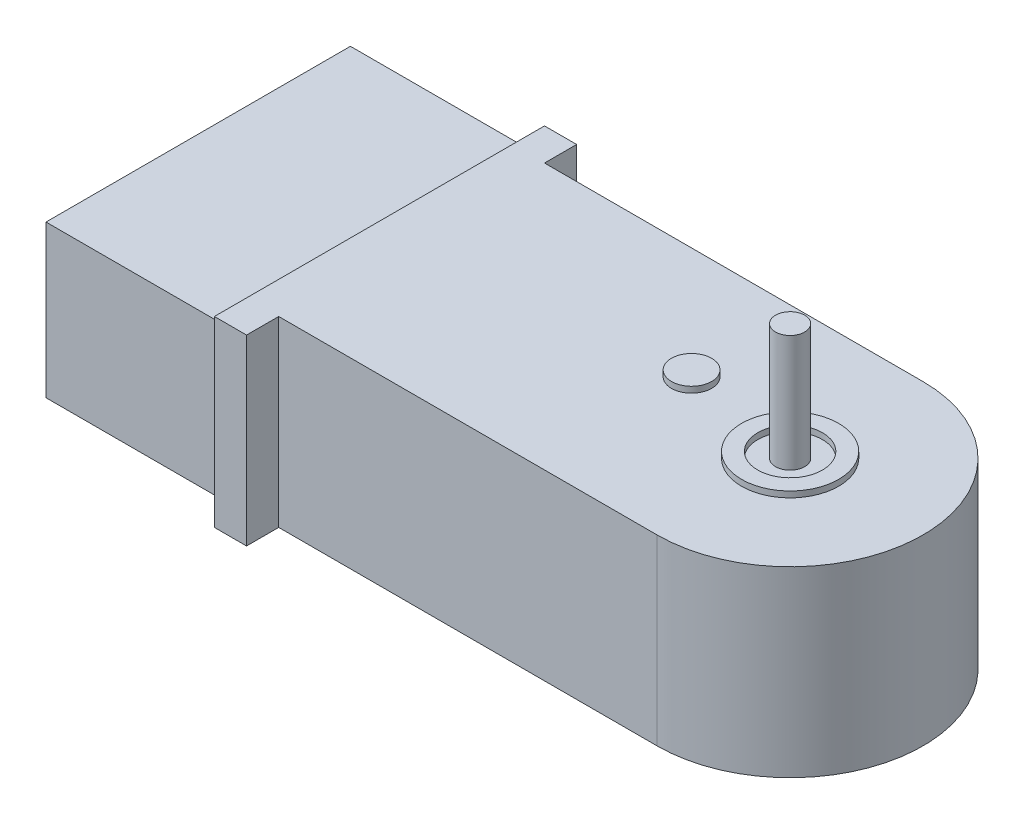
ISO-10303-21;
HEADER;
FILE_DESCRIPTION(('STEP AP214'),'2;1');
FILE_NAME('part.step','',(''),(''),'','','');
FILE_SCHEMA(('AUTOMOTIVE_DESIGN { 1 0 10303 214 1 1 1 1 }'));
ENDSEC;
DATA;
#1=APPLICATION_CONTEXT('core data for automotive mechanical design processes');
#2=APPLICATION_PROTOCOL_DEFINITION('international standard','automotive_design',2000,#1);
#3=PRODUCT_CONTEXT('',#1,'mechanical');
#4=PRODUCT('Part','Part','',(#3));
#5=PRODUCT_RELATED_PRODUCT_CATEGORY('part','',(#4));
#6=PRODUCT_DEFINITION_FORMATION('','',#4);
#7=PRODUCT_DEFINITION_CONTEXT('part definition',#1,'design');
#8=PRODUCT_DEFINITION('design','',#6,#7);
#9=PRODUCT_DEFINITION_SHAPE('','',#8);
#10=(LENGTH_UNIT() NAMED_UNIT(*) SI_UNIT(.MILLI.,.METRE.));
#11=(NAMED_UNIT(*) PLANE_ANGLE_UNIT() SI_UNIT($,.RADIAN.));
#12=(NAMED_UNIT(*) SI_UNIT($,.STERADIAN.) SOLID_ANGLE_UNIT());
#13=UNCERTAINTY_MEASURE_WITH_UNIT(LENGTH_MEASURE(1.E-05),#10,'distance_accuracy_value','');
#14=(GEOMETRIC_REPRESENTATION_CONTEXT(3) GLOBAL_UNCERTAINTY_ASSIGNED_CONTEXT((#13)) GLOBAL_UNIT_ASSIGNED_CONTEXT((#10,
#11,#12)) REPRESENTATION_CONTEXT('',''));
#15=CARTESIAN_POINT('',(0.,0.,0.));
#16=DIRECTION('',(0.,0.,1.));
#17=DIRECTION('',(1.,0.,0.));
#18=AXIS2_PLACEMENT_3D('',#15,#16,#17);
#19=CARTESIAN_POINT('',(0.,6.86,0.));
#20=DIRECTION('',(0.,1.,0.));
#21=DIRECTION('',(0.,0.,1.));
#22=AXIS2_PLACEMENT_3D('',#19,#20,#21);
#23=PLANE('',#22);
#24=CARTESIAN_POINT('',(0.,6.86,0.));
#25=DIRECTION('',(0.,1.,0.));
#26=DIRECTION('',(0.,0.,1.));
#27=AXIS2_PLACEMENT_3D('',#24,#25,#26);
#28=CIRCLE('',#27,2.43);
#29=CARTESIAN_POINT('',(0.,6.86,2.43));
#30=VERTEX_POINT('',#29);
#31=EDGE_CURVE('E40',#30,#30,#28,.F.);
#32=ORIENTED_EDGE('',*,*,#31,.F.);
#33=EDGE_LOOP('',(#32));
#34=FACE_BOUND('',#33,.T.);
#35=CARTESIAN_POINT('',(0.,6.86,0.));
#36=DIRECTION('',(0.,1.,0.));
#37=DIRECTION('',(0.,0.,1.));
#38=AXIS2_PLACEMENT_3D('',#35,#36,#37);
#39=CIRCLE('',#38,1.095);
#40=CARTESIAN_POINT('',(0.,6.86,1.095));
#41=VERTEX_POINT('',#40);
#42=EDGE_CURVE('E227',#41,#41,#39,.T.);
#43=ORIENTED_EDGE('',*,*,#42,.F.);
#44=EDGE_LOOP('',(#43));
#45=FACE_BOUND('',#44,.T.);
#46=ADVANCED_FACE('F32',(#34,#45),#23,.T.);
#47=CARTESIAN_POINT('',(0.,-6.86,0.));
#48=DIRECTION('',(0.,1.,0.));
#49=DIRECTION('',(0.,0.,1.));
#50=AXIS2_PLACEMENT_3D('',#47,#48,#49);
#51=PLANE('',#50);
#52=CARTESIAN_POINT('',(0.,-6.86,0.));
#53=DIRECTION('',(0.,1.,0.));
#54=DIRECTION('',(0.,0.,1.));
#55=AXIS2_PLACEMENT_3D('',#52,#53,#54);
#56=CIRCLE('',#55,9.98);
#57=CARTESIAN_POINT('',(0.,-6.86,9.98));
#58=VERTEX_POINT('',#57);
#59=CARTESIAN_POINT('',(0.,-6.86,-9.98));
#60=VERTEX_POINT('',#59);
#61=EDGE_CURVE('E178',#58,#60,#56,.T.);
#62=ORIENTED_EDGE('',*,*,#61,.F.);
#63=DIRECTION('',(1.,0.,0.));
#64=VECTOR('',#63,1.);
#65=CARTESIAN_POINT('',(-28.425,-6.86,9.98));
#66=LINE('',#65,#64);
#67=CARTESIAN_POINT('',(-28.425,-6.86,9.98));
#68=VERTEX_POINT('',#67);
#69=EDGE_CURVE('E198',#68,#58,#66,.T.);
#70=ORIENTED_EDGE('',*,*,#69,.F.);
#71=DIRECTION('',(0.,0.,-1.));
#72=VECTOR('',#71,1.);
#73=CARTESIAN_POINT('',(-28.425,-6.86,12.395));
#74=LINE('',#73,#72);
#75=CARTESIAN_POINT('',(-28.425,-6.86,12.395));
#76=VERTEX_POINT('',#75);
#77=EDGE_CURVE('E195',#76,#68,#74,.T.);
#78=ORIENTED_EDGE('',*,*,#77,.F.);
#79=DIRECTION('',(1.,0.,0.));
#80=VECTOR('',#79,1.);
#81=CARTESIAN_POINT('',(-30.84,-6.86,12.395));
#82=LINE('',#81,#80);
#83=CARTESIAN_POINT('',(-30.84,-6.86,12.395));
#84=VERTEX_POINT('',#83);
#85=EDGE_CURVE('E192',#84,#76,#82,.T.);
#86=ORIENTED_EDGE('',*,*,#85,.F.);
#87=DIRECTION('',(0.,0.,1.));
#88=VECTOR('',#87,1.);
#89=CARTESIAN_POINT('',(-30.84,-6.86,-12.395));
#90=LINE('',#89,#88);
#91=CARTESIAN_POINT('',(-30.84,-6.86,-12.395));
#92=VERTEX_POINT('',#91);
#93=EDGE_CURVE('E189',#92,#84,#90,.T.);
#94=ORIENTED_EDGE('',*,*,#93,.F.);
#95=DIRECTION('',(-1.,0.,0.));
#96=VECTOR('',#95,1.);
#97=CARTESIAN_POINT('',(-28.425,-6.86,-12.395));
#98=LINE('',#97,#96);
#99=CARTESIAN_POINT('',(-28.425,-6.86,-12.395));
#100=VERTEX_POINT('',#99);
#101=EDGE_CURVE('E186',#100,#92,#98,.T.);
#102=ORIENTED_EDGE('',*,*,#101,.F.);
#103=DIRECTION('',(0.,0.,-1.));
#104=VECTOR('',#103,1.);
#105=CARTESIAN_POINT('',(-28.425,-6.86,-9.98));
#106=LINE('',#105,#104);
#107=CARTESIAN_POINT('',(-28.425,-6.86,-9.98));
#108=VERTEX_POINT('',#107);
#109=EDGE_CURVE('E183',#108,#100,#106,.T.);
#110=ORIENTED_EDGE('',*,*,#109,.F.);
#111=DIRECTION('',(-1.,0.,0.));
#112=VECTOR('',#111,1.);
#113=CARTESIAN_POINT('',(0.,-6.86,-9.98));
#114=LINE('',#113,#112);
#115=EDGE_CURVE('E180',#60,#108,#114,.T.);
#116=ORIENTED_EDGE('',*,*,#115,.F.);
#117=EDGE_LOOP('',(#62,#70,#78,#86,#94,#102,#110,#116));
#118=FACE_BOUND('',#117,.T.);
#119=CARTESIAN_POINT('',(0.,-6.86,0.));
#120=DIRECTION('',(0.,1.,0.));
#121=DIRECTION('',(0.,0.,1.));
#122=AXIS2_PLACEMENT_3D('',#119,#120,#121);
#123=CIRCLE('',#122,3.645);
#124=CARTESIAN_POINT('',(0.,-6.86,3.645));
#125=VERTEX_POINT('',#124);
#126=EDGE_CURVE('E11',#125,#125,#123,.F.);
#127=ORIENTED_EDGE('',*,*,#126,.F.);
#128=EDGE_LOOP('',(#127));
#129=FACE_BOUND('',#128,.T.);
#130=ADVANCED_FACE('F222',(#118,#129),#51,.F.);
#131=CARTESIAN_POINT('',(0.,6.86,0.));
#132=DIRECTION('',(0.,1.,0.));
#133=DIRECTION('',(0.,0.,1.));
#134=AXIS2_PLACEMENT_3D('',#131,#132,#133);
#135=CIRCLE('',#134,9.98);
#136=CARTESIAN_POINT('',(0.,6.86,9.98));
#137=VERTEX_POINT('',#136);
#138=CARTESIAN_POINT('',(0.,6.86,-9.98));
#139=VERTEX_POINT('',#138);
#140=EDGE_CURVE('E153',#137,#139,#135,.T.);
#141=ORIENTED_EDGE('',*,*,#140,.T.);
#142=DIRECTION('',(-1.,0.,0.));
#143=VECTOR('',#142,1.);
#144=CARTESIAN_POINT('',(0.,6.86,-9.98));
#145=LINE('',#144,#143);
#146=CARTESIAN_POINT('',(-28.425,6.86,-9.98));
#147=VERTEX_POINT('',#146);
#148=EDGE_CURVE('E156',#139,#147,#145,.T.);
#149=ORIENTED_EDGE('',*,*,#148,.T.);
#150=DIRECTION('',(0.,0.,-1.));
#151=VECTOR('',#150,1.);
#152=CARTESIAN_POINT('',(-28.425,6.86,-9.98));
#153=LINE('',#152,#151);
#154=CARTESIAN_POINT('',(-28.425,6.86,-12.395));
#155=VERTEX_POINT('',#154);
#156=EDGE_CURVE('E160',#147,#155,#153,.T.);
#157=ORIENTED_EDGE('',*,*,#156,.T.);
#158=DIRECTION('',(-1.,0.,0.));
#159=VECTOR('',#158,1.);
#160=CARTESIAN_POINT('',(-28.425,6.86,-12.395));
#161=LINE('',#160,#159);
#162=CARTESIAN_POINT('',(-30.84,6.86,-12.395));
#163=VERTEX_POINT('',#162);
#164=EDGE_CURVE('E163',#155,#163,#161,.T.);
#165=ORIENTED_EDGE('',*,*,#164,.T.);
#166=DIRECTION('',(0.,0.,1.));
#167=VECTOR('',#166,1.);
#168=CARTESIAN_POINT('',(-30.84,6.86,-12.395));
#169=LINE('',#168,#167);
#170=CARTESIAN_POINT('',(-30.84,6.86,12.395));
#171=VERTEX_POINT('',#170);
#172=EDGE_CURVE('E166',#163,#171,#169,.T.);
#173=ORIENTED_EDGE('',*,*,#172,.T.);
#174=DIRECTION('',(1.,0.,0.));
#175=VECTOR('',#174,1.);
#176=CARTESIAN_POINT('',(-30.84,6.86,12.395));
#177=LINE('',#176,#175);
#178=CARTESIAN_POINT('',(-28.425,6.86,12.395));
#179=VERTEX_POINT('',#178);
#180=EDGE_CURVE('E169',#171,#179,#177,.T.);
#181=ORIENTED_EDGE('',*,*,#180,.T.);
#182=DIRECTION('',(0.,0.,-1.));
#183=VECTOR('',#182,1.);
#184=CARTESIAN_POINT('',(-28.425,6.86,12.395));
#185=LINE('',#184,#183);
#186=CARTESIAN_POINT('',(-28.425,6.86,9.98));
#187=VERTEX_POINT('',#186);
#188=EDGE_CURVE('E172',#179,#187,#185,.T.);
#189=ORIENTED_EDGE('',*,*,#188,.T.);
#190=DIRECTION('',(1.,0.,0.));
#191=VECTOR('',#190,1.);
#192=CARTESIAN_POINT('',(-28.425,6.86,9.98));
#193=LINE('',#192,#191);
#194=EDGE_CURVE('E175',#187,#137,#193,.T.);
#195=ORIENTED_EDGE('',*,*,#194,.T.);
#196=EDGE_LOOP('',(#141,#149,#157,#165,#173,#181,#189,#195));
#197=FACE_BOUND('',#196,.T.);
#198=CARTESIAN_POINT('',(-9.,6.86,-1.6));
#199=DIRECTION('',(0.,1.,0.));
#200=DIRECTION('',(0.,0.,1.));
#201=AXIS2_PLACEMENT_3D('',#198,#199,#200);
#202=CIRCLE('',#201,1.51);
#203=CARTESIAN_POINT('',(-9.,6.86,-0.0900000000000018));
#204=VERTEX_POINT('',#203);
#205=EDGE_CURVE('E250',#204,#204,#202,.T.);
#206=ORIENTED_EDGE('',*,*,#205,.F.);
#207=EDGE_LOOP('',(#206));
#208=FACE_BOUND('',#207,.T.);
#209=CARTESIAN_POINT('',(0.,6.86,0.));
#210=DIRECTION('',(0.,1.,0.));
#211=DIRECTION('',(0.,0.,1.));
#212=AXIS2_PLACEMENT_3D('',#209,#210,#211);
#213=CIRCLE('',#212,3.645);
#214=CARTESIAN_POINT('',(0.,6.86,3.645));
#215=VERTEX_POINT('',#214);
#216=EDGE_CURVE('E246',#215,#215,#213,.T.);
#217=ORIENTED_EDGE('',*,*,#216,.F.);
#218=EDGE_LOOP('',(#217));
#219=FACE_BOUND('',#218,.T.);
#220=ADVANCED_FACE('F224',(#197,#208,#219),#23,.T.);
#221=CARTESIAN_POINT('',(0.,-6.86,0.));
#222=DIRECTION('',(0.,1.,0.));
#223=DIRECTION('',(0.,0.,1.));
#224=AXIS2_PLACEMENT_3D('',#221,#222,#223);
#225=CYLINDRICAL_SURFACE('',#224,9.98);
#226=DIRECTION('',(0.,1.,0.));
#227=VECTOR('',#226,1.);
#228=CARTESIAN_POINT('',(0.,-6.86,-9.98));
#229=LINE('',#228,#227);
#230=EDGE_CURVE('E201',#60,#139,#229,.T.);
#231=ORIENTED_EDGE('',*,*,#230,.T.);
#232=ORIENTED_EDGE('',*,*,#140,.F.);
#233=DIRECTION('',(0.,1.,0.));
#234=VECTOR('',#233,1.);
#235=CARTESIAN_POINT('',(0.,-6.86,9.98));
#236=LINE('',#235,#234);
#237=EDGE_CURVE('E55',#58,#137,#236,.T.);
#238=ORIENTED_EDGE('',*,*,#237,.F.);
#239=ORIENTED_EDGE('',*,*,#61,.T.);
#240=EDGE_LOOP('',(#231,#232,#238,#239));
#241=FACE_BOUND('',#240,.T.);
#242=ADVANCED_FACE('F34',(#241),#225,.T.);
#243=CARTESIAN_POINT('',(-28.425,-6.86,9.98));
#244=DIRECTION('',(0.,0.,1.));
#245=DIRECTION('',(1.,0.,0.));
#246=AXIS2_PLACEMENT_3D('',#243,#244,#245);
#247=PLANE('',#246);
#248=ORIENTED_EDGE('',*,*,#237,.T.);
#249=ORIENTED_EDGE('',*,*,#194,.F.);
#250=DIRECTION('',(0.,1.,0.));
#251=VECTOR('',#250,1.);
#252=CARTESIAN_POINT('',(-28.425,-6.86,9.98));
#253=LINE('',#252,#251);
#254=EDGE_CURVE('E203',#68,#187,#253,.T.);
#255=ORIENTED_EDGE('',*,*,#254,.F.);
#256=ORIENTED_EDGE('',*,*,#69,.T.);
#257=EDGE_LOOP('',(#248,#249,#255,#256));
#258=FACE_BOUND('',#257,.T.);
#259=ADVANCED_FACE('F294',(#258),#247,.T.);
#260=CARTESIAN_POINT('',(-28.425,-6.86,12.395));
#261=DIRECTION('',(1.,0.,0.));
#262=DIRECTION('',(0.,0.,-1.));
#263=AXIS2_PLACEMENT_3D('',#260,#261,#262);
#264=PLANE('',#263);
#265=ORIENTED_EDGE('',*,*,#254,.T.);
#266=ORIENTED_EDGE('',*,*,#188,.F.);
#267=DIRECTION('',(0.,1.,0.));
#268=VECTOR('',#267,1.);
#269=CARTESIAN_POINT('',(-28.425,-6.86,12.395));
#270=LINE('',#269,#268);
#271=EDGE_CURVE('E205',#76,#179,#270,.T.);
#272=ORIENTED_EDGE('',*,*,#271,.F.);
#273=ORIENTED_EDGE('',*,*,#77,.T.);
#274=EDGE_LOOP('',(#265,#266,#272,#273));
#275=FACE_BOUND('',#274,.T.);
#276=ADVANCED_FACE('F297',(#275),#264,.T.);
#277=CARTESIAN_POINT('',(-30.84,-6.86,12.395));
#278=DIRECTION('',(0.,0.,1.));
#279=DIRECTION('',(1.,0.,0.));
#280=AXIS2_PLACEMENT_3D('',#277,#278,#279);
#281=PLANE('',#280);
#282=ORIENTED_EDGE('',*,*,#271,.T.);
#283=ORIENTED_EDGE('',*,*,#180,.F.);
#284=DIRECTION('',(0.,1.,0.));
#285=VECTOR('',#284,1.);
#286=CARTESIAN_POINT('',(-30.84,-6.86,12.395));
#287=LINE('',#286,#285);
#288=EDGE_CURVE('E207',#84,#171,#287,.T.);
#289=ORIENTED_EDGE('',*,*,#288,.F.);
#290=ORIENTED_EDGE('',*,*,#85,.T.);
#291=EDGE_LOOP('',(#282,#283,#289,#290));
#292=FACE_BOUND('',#291,.T.);
#293=ADVANCED_FACE('F301',(#292),#281,.T.);
#294=CARTESIAN_POINT('',(-30.84,-6.86,-12.395));
#295=DIRECTION('',(-1.,0.,0.));
#296=DIRECTION('',(0.,0.,1.));
#297=AXIS2_PLACEMENT_3D('',#294,#295,#296);
#298=PLANE('',#297);
#299=DIRECTION('',(0.,0.,-1.));
#300=VECTOR('',#299,1.);
#301=CARTESIAN_POINT('',(-30.84,-5.715,-11.43));
#302=LINE('',#301,#300);
#303=CARTESIAN_POINT('',(-30.84,-5.715,11.43));
#304=VERTEX_POINT('',#303);
#305=CARTESIAN_POINT('',(-30.84,-5.715,-11.43));
#306=VERTEX_POINT('',#305);
#307=EDGE_CURVE('E143',#304,#306,#302,.T.);
#308=ORIENTED_EDGE('',*,*,#307,.T.);
#309=DIRECTION('',(0.,1.,0.));
#310=VECTOR('',#309,1.);
#311=CARTESIAN_POINT('',(-30.84,-5.715,-11.43));
#312=LINE('',#311,#310);
#313=CARTESIAN_POINT('',(-30.84,5.715,-11.43));
#314=VERTEX_POINT('',#313);
#315=EDGE_CURVE('E127',#306,#314,#312,.T.);
#316=ORIENTED_EDGE('',*,*,#315,.T.);
#317=DIRECTION('',(0.,0.,-1.));
#318=VECTOR('',#317,1.);
#319=CARTESIAN_POINT('',(-30.84,5.715,-11.43));
#320=LINE('',#319,#318);
#321=CARTESIAN_POINT('',(-30.84,5.715,11.43));
#322=VERTEX_POINT('',#321);
#323=EDGE_CURVE('E132',#322,#314,#320,.T.);
#324=ORIENTED_EDGE('',*,*,#323,.F.);
#325=DIRECTION('',(0.,1.,0.));
#326=VECTOR('',#325,1.);
#327=CARTESIAN_POINT('',(-30.84,-5.715,11.43));
#328=LINE('',#327,#326);
#329=EDGE_CURVE('E157',#304,#322,#328,.T.);
#330=ORIENTED_EDGE('',*,*,#329,.F.);
#331=EDGE_LOOP('',(#308,#316,#324,#330));
#332=FACE_BOUND('',#331,.T.);
#333=ORIENTED_EDGE('',*,*,#288,.T.);
#334=ORIENTED_EDGE('',*,*,#172,.F.);
#335=DIRECTION('',(0.,1.,0.));
#336=VECTOR('',#335,1.);
#337=CARTESIAN_POINT('',(-30.84,-6.86,-12.395));
#338=LINE('',#337,#336);
#339=EDGE_CURVE('E209',#92,#163,#338,.T.);
#340=ORIENTED_EDGE('',*,*,#339,.F.);
#341=ORIENTED_EDGE('',*,*,#93,.T.);
#342=EDGE_LOOP('',(#333,#334,#340,#341));
#343=FACE_BOUND('',#342,.T.);
#344=ADVANCED_FACE('F141',(#332,#343),#298,.T.);
#345=CARTESIAN_POINT('',(-28.425,-6.86,-12.395));
#346=DIRECTION('',(0.,0.,-1.));
#347=DIRECTION('',(-1.,0.,0.));
#348=AXIS2_PLACEMENT_3D('',#345,#346,#347);
#349=PLANE('',#348);
#350=ORIENTED_EDGE('',*,*,#339,.T.);
#351=ORIENTED_EDGE('',*,*,#164,.F.);
#352=DIRECTION('',(0.,1.,0.));
#353=VECTOR('',#352,1.);
#354=CARTESIAN_POINT('',(-28.425,-6.86,-12.395));
#355=LINE('',#354,#353);
#356=EDGE_CURVE('E211',#100,#155,#355,.T.);
#357=ORIENTED_EDGE('',*,*,#356,.F.);
#358=ORIENTED_EDGE('',*,*,#101,.T.);
#359=EDGE_LOOP('',(#350,#351,#357,#358));
#360=FACE_BOUND('',#359,.T.);
#361=ADVANCED_FACE('F308',(#360),#349,.T.);
#362=CARTESIAN_POINT('',(-28.425,-6.86,-9.98));
#363=DIRECTION('',(1.,0.,0.));
#364=DIRECTION('',(0.,0.,-1.));
#365=AXIS2_PLACEMENT_3D('',#362,#363,#364);
#366=PLANE('',#365);
#367=ORIENTED_EDGE('',*,*,#356,.T.);
#368=ORIENTED_EDGE('',*,*,#156,.F.);
#369=DIRECTION('',(0.,1.,0.));
#370=VECTOR('',#369,1.);
#371=CARTESIAN_POINT('',(-28.425,-6.86,-9.98));
#372=LINE('',#371,#370);
#373=EDGE_CURVE('E213',#108,#147,#372,.T.);
#374=ORIENTED_EDGE('',*,*,#373,.F.);
#375=ORIENTED_EDGE('',*,*,#109,.T.);
#376=EDGE_LOOP('',(#367,#368,#374,#375));
#377=FACE_BOUND('',#376,.T.);
#378=ADVANCED_FACE('F311',(#377),#366,.T.);
#379=CARTESIAN_POINT('',(0.,-6.86,-9.98));
#380=DIRECTION('',(0.,0.,-1.));
#381=DIRECTION('',(-1.,0.,0.));
#382=AXIS2_PLACEMENT_3D('',#379,#380,#381);
#383=PLANE('',#382);
#384=ORIENTED_EDGE('',*,*,#373,.T.);
#385=ORIENTED_EDGE('',*,*,#148,.F.);
#386=ORIENTED_EDGE('',*,*,#230,.F.);
#387=ORIENTED_EDGE('',*,*,#115,.T.);
#388=EDGE_LOOP('',(#384,#385,#386,#387));
#389=FACE_BOUND('',#388,.T.);
#390=ADVANCED_FACE('F285',(#389),#383,.T.);
#391=CARTESIAN_POINT('',(-30.84,-5.715,11.43));
#392=DIRECTION('',(0.,0.,1.));
#393=DIRECTION('',(1.,0.,0.));
#394=AXIS2_PLACEMENT_3D('',#391,#392,#393);
#395=PLANE('',#394);
#396=ORIENTED_EDGE('',*,*,#329,.T.);
#397=DIRECTION('',(1.,0.,0.));
#398=VECTOR('',#397,1.);
#399=CARTESIAN_POINT('',(-30.84,5.715,11.43));
#400=LINE('',#399,#398);
#401=CARTESIAN_POINT('',(-44.45,5.715,11.43));
#402=VERTEX_POINT('',#401);
#403=EDGE_CURVE('E47',#402,#322,#400,.T.);
#404=ORIENTED_EDGE('',*,*,#403,.F.);
#405=DIRECTION('',(0.,1.,0.));
#406=VECTOR('',#405,1.);
#407=CARTESIAN_POINT('',(-44.45,-5.715,11.43));
#408=LINE('',#407,#406);
#409=CARTESIAN_POINT('',(-44.45,-5.715,11.43));
#410=VERTEX_POINT('',#409);
#411=EDGE_CURVE('E146',#410,#402,#408,.T.);
#412=ORIENTED_EDGE('',*,*,#411,.F.);
#413=DIRECTION('',(1.,0.,0.));
#414=VECTOR('',#413,1.);
#415=CARTESIAN_POINT('',(-30.84,-5.715,11.43));
#416=LINE('',#415,#414);
#417=EDGE_CURVE('E144',#410,#304,#416,.T.);
#418=ORIENTED_EDGE('',*,*,#417,.T.);
#419=EDGE_LOOP('',(#396,#404,#412,#418));
#420=FACE_BOUND('',#419,.T.);
#421=ADVANCED_FACE('F269',(#420),#395,.T.);
#422=CARTESIAN_POINT('',(-44.45,-5.715,-11.43));
#423=DIRECTION('',(-1.,0.,0.));
#424=DIRECTION('',(0.,0.,1.));
#425=AXIS2_PLACEMENT_3D('',#422,#423,#424);
#426=PLANE('',#425);
#427=ORIENTED_EDGE('',*,*,#411,.T.);
#428=DIRECTION('',(0.,0.,1.));
#429=VECTOR('',#428,1.);
#430=CARTESIAN_POINT('',(-44.45,5.715,-11.43));
#431=LINE('',#430,#429);
#432=CARTESIAN_POINT('',(-44.45,5.715,-11.43));
#433=VERTEX_POINT('',#432);
#434=EDGE_CURVE('E131',#433,#402,#431,.T.);
#435=ORIENTED_EDGE('',*,*,#434,.F.);
#436=DIRECTION('',(0.,1.,0.));
#437=VECTOR('',#436,1.);
#438=CARTESIAN_POINT('',(-44.45,-5.715,-11.43));
#439=LINE('',#438,#437);
#440=CARTESIAN_POINT('',(-44.45,-5.715,-11.43));
#441=VERTEX_POINT('',#440);
#442=EDGE_CURVE('E129',#441,#433,#439,.T.);
#443=ORIENTED_EDGE('',*,*,#442,.F.);
#444=DIRECTION('',(0.,0.,1.));
#445=VECTOR('',#444,1.);
#446=CARTESIAN_POINT('',(-44.45,-5.715,-11.43));
#447=LINE('',#446,#445);
#448=EDGE_CURVE('E149',#441,#410,#447,.T.);
#449=ORIENTED_EDGE('',*,*,#448,.T.);
#450=EDGE_LOOP('',(#427,#435,#443,#449));
#451=FACE_BOUND('',#450,.T.);
#452=ADVANCED_FACE('F265',(#451),#426,.T.);
#453=CARTESIAN_POINT('',(-30.84,-5.715,-11.43));
#454=DIRECTION('',(0.,0.,-1.));
#455=DIRECTION('',(-1.,0.,0.));
#456=AXIS2_PLACEMENT_3D('',#453,#454,#455);
#457=PLANE('',#456);
#458=ORIENTED_EDGE('',*,*,#442,.T.);
#459=DIRECTION('',(-1.,0.,0.));
#460=VECTOR('',#459,1.);
#461=CARTESIAN_POINT('',(-30.84,5.715,-11.43));
#462=LINE('',#461,#460);
#463=EDGE_CURVE('E123',#314,#433,#462,.T.);
#464=ORIENTED_EDGE('',*,*,#463,.F.);
#465=ORIENTED_EDGE('',*,*,#315,.F.);
#466=DIRECTION('',(-1.,0.,0.));
#467=VECTOR('',#466,1.);
#468=CARTESIAN_POINT('',(-30.84,-5.715,-11.43));
#469=LINE('',#468,#467);
#470=EDGE_CURVE('E260',#306,#441,#469,.T.);
#471=ORIENTED_EDGE('',*,*,#470,.T.);
#472=EDGE_LOOP('',(#458,#464,#465,#471));
#473=FACE_BOUND('',#472,.T.);
#474=ADVANCED_FACE('F124',(#473),#457,.T.);
#475=CARTESIAN_POINT('',(-30.84,-5.715,11.43));
#476=DIRECTION('',(0.,-1.,0.));
#477=DIRECTION('',(0.,0.,-1.));
#478=AXIS2_PLACEMENT_3D('',#475,#476,#477);
#479=PLANE('',#478);
#480=ORIENTED_EDGE('',*,*,#307,.F.);
#481=ORIENTED_EDGE('',*,*,#417,.F.);
#482=ORIENTED_EDGE('',*,*,#448,.F.);
#483=ORIENTED_EDGE('',*,*,#470,.F.);
#484=EDGE_LOOP('',(#480,#481,#482,#483));
#485=FACE_BOUND('',#484,.T.);
#486=ADVANCED_FACE('F271',(#485),#479,.T.);
#487=CARTESIAN_POINT('',(-30.84,5.715,11.43));
#488=DIRECTION('',(0.,-1.,0.));
#489=DIRECTION('',(0.,0.,-1.));
#490=AXIS2_PLACEMENT_3D('',#487,#488,#489);
#491=PLANE('',#490);
#492=ORIENTED_EDGE('',*,*,#323,.T.);
#493=ORIENTED_EDGE('',*,*,#463,.T.);
#494=ORIENTED_EDGE('',*,*,#434,.T.);
#495=ORIENTED_EDGE('',*,*,#403,.T.);
#496=EDGE_LOOP('',(#492,#493,#494,#495));
#497=FACE_BOUND('',#496,.T.);
#498=ADVANCED_FACE('F135',(#497),#491,.F.);
#499=CARTESIAN_POINT('',(-9.,7.31,-1.6));
#500=DIRECTION('',(0.,-1.,0.));
#501=DIRECTION('',(0.,0.,-1.));
#502=AXIS2_PLACEMENT_3D('',#499,#500,#501);
#503=CYLINDRICAL_SURFACE('',#502,1.51);
#504=CARTESIAN_POINT('',(-9.,7.31,-1.6));
#505=DIRECTION('',(0.,1.,0.));
#506=DIRECTION('',(0.,0.,1.));
#507=AXIS2_PLACEMENT_3D('',#504,#505,#506);
#508=CIRCLE('',#507,1.51);
#509=CARTESIAN_POINT('',(-9.,7.31,-0.0900000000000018));
#510=VERTEX_POINT('',#509);
#511=EDGE_CURVE('E138',#510,#510,#508,.T.);
#512=ORIENTED_EDGE('',*,*,#511,.F.);
#513=EDGE_LOOP('',(#512));
#514=FACE_BOUND('',#513,.T.);
#515=ORIENTED_EDGE('',*,*,#205,.T.);
#516=EDGE_LOOP('',(#515));
#517=FACE_BOUND('',#516,.T.);
#518=ADVANCED_FACE('F278',(#514,#517),#503,.T.);
#519=CARTESIAN_POINT('',(-9.,7.31,-1.6));
#520=DIRECTION('',(0.,1.,0.));
#521=DIRECTION('',(0.,0.,1.));
#522=AXIS2_PLACEMENT_3D('',#519,#520,#521);
#523=PLANE('',#522);
#524=ORIENTED_EDGE('',*,*,#511,.T.);
#525=EDGE_LOOP('',(#524));
#526=FACE_BOUND('',#525,.T.);
#527=ADVANCED_FACE('F399',(#526),#523,.T.);
#528=CARTESIAN_POINT('',(0.,7.31,0.));
#529=DIRECTION('',(0.,1.,0.));
#530=DIRECTION('',(0.,0.,1.));
#531=AXIS2_PLACEMENT_3D('',#528,#529,#530);
#532=PLANE('',#531);
#533=CARTESIAN_POINT('',(0.,7.31,0.));
#534=DIRECTION('',(0.,1.,0.));
#535=DIRECTION('',(0.,0.,1.));
#536=AXIS2_PLACEMENT_3D('',#533,#534,#535);
#537=CIRCLE('',#536,3.645);
#538=CARTESIAN_POINT('',(0.,7.31,3.645));
#539=VERTEX_POINT('',#538);
#540=EDGE_CURVE('E247',#539,#539,#537,.T.);
#541=ORIENTED_EDGE('',*,*,#540,.T.);
#542=EDGE_LOOP('',(#541));
#543=FACE_BOUND('',#542,.T.);
#544=CARTESIAN_POINT('',(0.,7.31,0.));
#545=DIRECTION('',(0.,1.,0.));
#546=DIRECTION('',(0.,0.,1.));
#547=AXIS2_PLACEMENT_3D('',#544,#545,#546);
#548=CIRCLE('',#547,2.43);
#549=CARTESIAN_POINT('',(0.,7.31,2.43));
#550=VERTEX_POINT('',#549);
#551=EDGE_CURVE('E243',#550,#550,#548,.T.);
#552=ORIENTED_EDGE('',*,*,#551,.F.);
#553=EDGE_LOOP('',(#552));
#554=FACE_BOUND('',#553,.T.);
#555=ADVANCED_FACE('F396',(#543,#554),#532,.T.);
#556=CARTESIAN_POINT('',(0.,7.31,0.));
#557=DIRECTION('',(0.,-1.,0.));
#558=DIRECTION('',(0.,0.,-1.));
#559=AXIS2_PLACEMENT_3D('',#556,#557,#558);
#560=CYLINDRICAL_SURFACE('',#559,3.645);
#561=ORIENTED_EDGE('',*,*,#540,.F.);
#562=EDGE_LOOP('',(#561));
#563=FACE_BOUND('',#562,.T.);
#564=ORIENTED_EDGE('',*,*,#216,.T.);
#565=EDGE_LOOP('',(#564));
#566=FACE_BOUND('',#565,.T.);
#567=ADVANCED_FACE('F394',(#563,#566),#560,.T.);
#568=CARTESIAN_POINT('',(0.,7.31,0.));
#569=DIRECTION('',(0.,-1.,0.));
#570=DIRECTION('',(0.,0.,-1.));
#571=AXIS2_PLACEMENT_3D('',#568,#569,#570);
#572=CYLINDRICAL_SURFACE('',#571,2.43);
#573=ORIENTED_EDGE('',*,*,#551,.T.);
#574=EDGE_LOOP('',(#573));
#575=FACE_BOUND('',#574,.T.);
#576=ORIENTED_EDGE('',*,*,#31,.T.);
#577=EDGE_LOOP('',(#576));
#578=FACE_BOUND('',#577,.T.);
#579=ADVANCED_FACE('F218',(#575,#578),#572,.F.);
#580=CARTESIAN_POINT('',(0.,-7.31,0.));
#581=DIRECTION('',(0.,-1.,0.));
#582=DIRECTION('',(0.,0.,-1.));
#583=AXIS2_PLACEMENT_3D('',#580,#581,#582);
#584=PLANE('',#583);
#585=CARTESIAN_POINT('',(0.,-7.31,0.));
#586=DIRECTION('',(0.,-1.,0.));
#587=DIRECTION('',(0.,0.,-1.));
#588=AXIS2_PLACEMENT_3D('',#585,#586,#587);
#589=CIRCLE('',#588,3.645);
#590=CARTESIAN_POINT('',(0.,-7.31,-3.645));
#591=VERTEX_POINT('',#590);
#592=EDGE_CURVE('E238',#591,#591,#589,.T.);
#593=ORIENTED_EDGE('',*,*,#592,.T.);
#594=EDGE_LOOP('',(#593));
#595=FACE_BOUND('',#594,.T.);
#596=CARTESIAN_POINT('',(0.,-7.31,0.));
#597=DIRECTION('',(0.,-1.,0.));
#598=DIRECTION('',(0.,0.,-1.));
#599=AXIS2_PLACEMENT_3D('',#596,#597,#598);
#600=CIRCLE('',#599,2.43);
#601=CARTESIAN_POINT('',(0.,-7.31,-2.43));
#602=VERTEX_POINT('',#601);
#603=EDGE_CURVE('E235',#602,#602,#600,.T.);
#604=ORIENTED_EDGE('',*,*,#603,.F.);
#605=EDGE_LOOP('',(#604));
#606=FACE_BOUND('',#605,.T.);
#607=ADVANCED_FACE('F385',(#595,#606),#584,.T.);
#608=CARTESIAN_POINT('',(0.,-7.31,0.));
#609=DIRECTION('',(0.,1.,0.));
#610=DIRECTION('',(0.,0.,1.));
#611=AXIS2_PLACEMENT_3D('',#608,#609,#610);
#612=CYLINDRICAL_SURFACE('',#611,3.645);
#613=ORIENTED_EDGE('',*,*,#592,.F.);
#614=EDGE_LOOP('',(#613));
#615=FACE_BOUND('',#614,.T.);
#616=ORIENTED_EDGE('',*,*,#126,.T.);
#617=EDGE_LOOP('',(#616));
#618=FACE_BOUND('',#617,.T.);
#619=ADVANCED_FACE('F383',(#615,#618),#612,.T.);
#620=CARTESIAN_POINT('',(0.,-7.31,0.));
#621=DIRECTION('',(0.,1.,0.));
#622=DIRECTION('',(0.,0.,1.));
#623=AXIS2_PLACEMENT_3D('',#620,#621,#622);
#624=CYLINDRICAL_SURFACE('',#623,2.43);
#625=ORIENTED_EDGE('',*,*,#603,.T.);
#626=EDGE_LOOP('',(#625));
#627=FACE_BOUND('',#626,.T.);
#628=CARTESIAN_POINT('',(0.,-6.86,0.));
#629=DIRECTION('',(0.,-1.,0.));
#630=DIRECTION('',(0.,0.,-1.));
#631=AXIS2_PLACEMENT_3D('',#628,#629,#630);
#632=CIRCLE('',#631,2.43);
#633=CARTESIAN_POINT('',(0.,-6.86,-2.43));
#634=VERTEX_POINT('',#633);
#635=EDGE_CURVE('E232',#634,#634,#632,.T.);
#636=ORIENTED_EDGE('',*,*,#635,.F.);
#637=EDGE_LOOP('',(#636));
#638=FACE_BOUND('',#637,.T.);
#639=ADVANCED_FACE('F292',(#627,#638),#624,.F.);
#640=ORIENTED_EDGE('',*,*,#635,.T.);
#641=EDGE_LOOP('',(#640));
#642=FACE_BOUND('',#641,.T.);
#643=ADVANCED_FACE('F288',(#642),#51,.F.);
#644=CARTESIAN_POINT('',(0.,15.62,0.));
#645=DIRECTION('',(0.,-1.,0.));
#646=DIRECTION('',(0.,0.,-1.));
#647=AXIS2_PLACEMENT_3D('',#644,#645,#646);
#648=CYLINDRICAL_SURFACE('',#647,1.095);
#649=CARTESIAN_POINT('',(0.,15.62,0.));
#650=DIRECTION('',(0.,1.,0.));
#651=DIRECTION('',(0.,0.,1.));
#652=AXIS2_PLACEMENT_3D('',#649,#650,#651);
#653=CIRCLE('',#652,1.095);
#654=CARTESIAN_POINT('',(0.,15.62,1.095));
#655=VERTEX_POINT('',#654);
#656=EDGE_CURVE('E229',#655,#655,#653,.T.);
#657=ORIENTED_EDGE('',*,*,#656,.F.);
#658=EDGE_LOOP('',(#657));
#659=FACE_BOUND('',#658,.T.);
#660=ORIENTED_EDGE('',*,*,#42,.T.);
#661=EDGE_LOOP('',(#660));
#662=FACE_BOUND('',#661,.T.);
#663=ADVANCED_FACE('F291',(#659,#662),#648,.T.);
#664=CARTESIAN_POINT('',(0.,15.62,0.));
#665=DIRECTION('',(0.,1.,0.));
#666=DIRECTION('',(0.,0.,1.));
#667=AXIS2_PLACEMENT_3D('',#664,#665,#666);
#668=PLANE('',#667);
#669=ORIENTED_EDGE('',*,*,#656,.T.);
#670=EDGE_LOOP('',(#669));
#671=FACE_BOUND('',#670,.T.);
#672=ADVANCED_FACE('F366',(#671),#668,.T.);
#673=CLOSED_SHELL('',(#46,#130,#220,#242,#259,#276,#293,#344,#361,#378,#390,#421,#452,#474,#486,
#498,#518,#527,#555,#567,#579,#607,#619,#639,#643,#663,#672));
#674=MANIFOLD_SOLID_BREP('B2',#673);
#675=ADVANCED_BREP_SHAPE_REPRESENTATION('',(#18,#674),#14);
#676=SHAPE_DEFINITION_REPRESENTATION(#9,#675);
ENDSEC;
END-ISO-10303-21;
